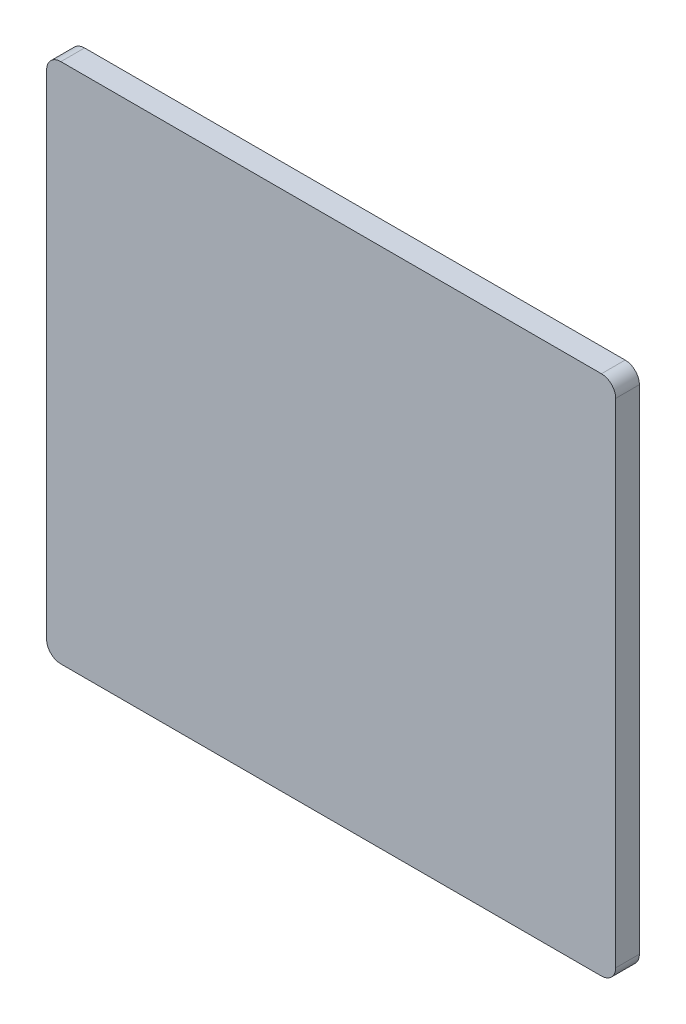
from build123d import *

# Parameters (mm, degrees)
SKETCH1_W           = 120
SKETCH1_H           = 110
BOSS_EXTRUDE1_DEPTH = 2.5
FILLET1_R           = 3


with BuildPart() as part:
    # Sketch1 → Boss-Extrude1 (new, symmetric)
    with BuildSketch(Plane.XY):
        Rectangle(SKETCH1_W, SKETCH1_H)
    extrude(amount=BOSS_EXTRUDE1_DEPTH, both=True)

    # Fillet1
    fillet1_edges = [part.edges().sort_by_distance(p)[0] for p in [
        (-60, 55, 0),
        (60, 55, 0),
        (60, -55, 0),
        (-60, -55, 0),
    ]]
    fillet(fillet1_edges, radius=FILLET1_R)


solid = part.part
